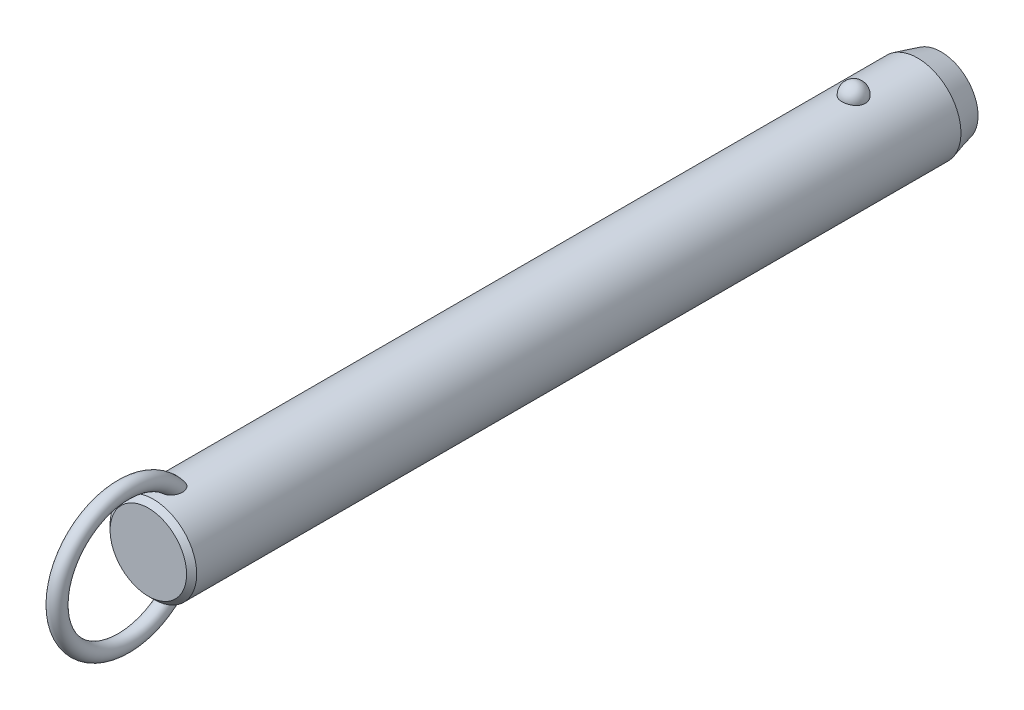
ISO-10303-21;
HEADER;
FILE_DESCRIPTION(('STEP AP214'),'2;1');
FILE_NAME('part.step','',(''),(''),'','','');
FILE_SCHEMA(('AUTOMOTIVE_DESIGN { 1 0 10303 214 1 1 1 1 }'));
ENDSEC;
DATA;
#1=APPLICATION_CONTEXT('core data for automotive mechanical design processes');
#2=APPLICATION_PROTOCOL_DEFINITION('international standard','automotive_design',2000,#1);
#3=PRODUCT_CONTEXT('',#1,'mechanical');
#4=PRODUCT('Part','Part','',(#3));
#5=PRODUCT_RELATED_PRODUCT_CATEGORY('part','',(#4));
#6=PRODUCT_DEFINITION_FORMATION('','',#4);
#7=PRODUCT_DEFINITION_CONTEXT('part definition',#1,'design');
#8=PRODUCT_DEFINITION('design','',#6,#7);
#9=PRODUCT_DEFINITION_SHAPE('','',#8);
#10=(LENGTH_UNIT() NAMED_UNIT(*) SI_UNIT(.MILLI.,.METRE.));
#11=(NAMED_UNIT(*) PLANE_ANGLE_UNIT() SI_UNIT($,.RADIAN.));
#12=(NAMED_UNIT(*) SI_UNIT($,.STERADIAN.) SOLID_ANGLE_UNIT());
#13=UNCERTAINTY_MEASURE_WITH_UNIT(LENGTH_MEASURE(1.E-05),#10,'distance_accuracy_value','');
#14=(GEOMETRIC_REPRESENTATION_CONTEXT(3) GLOBAL_UNCERTAINTY_ASSIGNED_CONTEXT((#13)) GLOBAL_UNIT_ASSIGNED_CONTEXT((#10,
#11,#12)) REPRESENTATION_CONTEXT('',''));
#15=CARTESIAN_POINT('',(0.,0.,0.));
#16=DIRECTION('',(0.,0.,1.));
#17=DIRECTION('',(1.,0.,0.));
#18=AXIS2_PLACEMENT_3D('',#15,#16,#17);
#19=CARTESIAN_POINT('',(0.,0.,165.1));
#20=DIRECTION('',(0.,0.,-1.));
#21=DIRECTION('',(-1.,0.,0.));
#22=AXIS2_PLACEMENT_3D('',#19,#20,#21);
#23=CYLINDRICAL_SURFACE('',#22,11.1);
#24=CARTESIAN_POINT('',(2.9724815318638,10.6945945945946,-3.00000000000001));
#25=CARTESIAN_POINT('',(2.97247830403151,10.6945972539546,-2.8322505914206));
#26=CARTESIAN_POINT('',(2.95876598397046,10.6984356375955,-2.66445972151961));
#27=CARTESIAN_POINT('',(2.90424529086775,10.7133624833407,-2.3336238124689));
#28=CARTESIAN_POINT('',(2.8634252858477,10.7244540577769,-2.17058084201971));
#29=CARTESIAN_POINT('',(2.75573657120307,10.7526272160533,-1.85396767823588));
#30=CARTESIAN_POINT('',(2.68887937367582,10.7697061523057,-1.70039333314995));
#31=CARTESIAN_POINT('',(2.53079696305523,10.8079438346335,-1.4069159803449));
#32=CARTESIAN_POINT('',(2.43957264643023,10.8291024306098,-1.26701246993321));
#33=CARTESIAN_POINT('',(2.23458150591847,10.8732541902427,-1.00409565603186));
#34=CARTESIAN_POINT('',(2.12071295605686,10.8962553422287,-0.881162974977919));
#35=CARTESIAN_POINT('',(1.87365402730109,10.9414421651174,-0.656352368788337));
#36=CARTESIAN_POINT('',(1.74046358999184,10.9636278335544,-0.554474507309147));
#37=CARTESIAN_POINT('',(1.45872188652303,11.0046495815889,-0.374872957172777));
#38=CARTESIAN_POINT('',(1.31021276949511,11.0234944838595,-0.297085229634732));
#39=CARTESIAN_POINT('',(1.00170030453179,11.0557957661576,-0.167529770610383));
#40=CARTESIAN_POINT('',(0.841698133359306,11.0692526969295,-0.1157593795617));
#41=CARTESIAN_POINT('',(0.517607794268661,11.0890932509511,-0.0403925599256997));
#42=CARTESIAN_POINT('',(0.353633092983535,11.0955916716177,-0.0163383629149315));
#43=CARTESIAN_POINT('',(0.0238420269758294,11.1011989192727,0.00445177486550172));
#44=CARTESIAN_POINT('',(-0.141974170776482,11.1003084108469,0.00119017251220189));
#45=CARTESIAN_POINT('',(-0.468405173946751,11.0912990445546,-0.0323233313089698));
#46=CARTESIAN_POINT('',(-0.629059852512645,11.0832767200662,-0.062214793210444));
#47=CARTESIAN_POINT('',(-0.942937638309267,11.0609962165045,-0.147645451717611));
#48=CARTESIAN_POINT('',(-1.09616062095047,11.0467379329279,-0.203185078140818));
#49=CARTESIAN_POINT('',(-1.39181061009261,11.0134071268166,-0.338752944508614));
#50=CARTESIAN_POINT('',(-1.53417383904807,10.9943086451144,-0.418913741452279));
#51=CARTESIAN_POINT('',(-1.80342160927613,10.9533667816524,-0.601448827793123));
#52=CARTESIAN_POINT('',(-1.9303046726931,10.9315231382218,-0.703825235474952));
#53=CARTESIAN_POINT('',(-2.16747598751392,10.887005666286,-0.930091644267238));
#54=CARTESIAN_POINT('',(-2.27742774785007,10.8643239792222,-1.05433291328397));
#55=CARTESIAN_POINT('',(-2.47517316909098,10.8209886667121,-1.31966633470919));
#56=CARTESIAN_POINT('',(-2.56296538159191,10.8003351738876,-1.46075958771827));
#57=CARTESIAN_POINT('',(-2.71500300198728,10.7631304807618,-1.75753646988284));
#58=CARTESIAN_POINT('',(-2.77898901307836,10.7466250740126,-1.91335887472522));
#59=CARTESIAN_POINT('',(-2.88046189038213,10.7198747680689,-2.23391529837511));
#60=CARTESIAN_POINT('',(-2.91794947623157,10.709629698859,-2.3986490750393));
#61=CARTESIAN_POINT('',(-2.96537819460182,10.6965949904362,-2.73165170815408));
#62=CARTESIAN_POINT('',(-2.97542891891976,10.693775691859,-2.89990378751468));
#63=CARTESIAN_POINT('',(-2.96804271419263,10.6958279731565,-3.23575286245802));
#64=CARTESIAN_POINT('',(-2.95060646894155,10.7006993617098,-3.4033498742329));
#65=CARTESIAN_POINT('',(-2.88883358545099,10.71753912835,-3.73233906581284));
#66=CARTESIAN_POINT('',(-2.84462026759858,10.7294749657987,-3.89375610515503));
#67=CARTESIAN_POINT('',(-2.73050447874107,10.7590797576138,-4.20667949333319));
#68=CARTESIAN_POINT('',(-2.66060103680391,10.7767489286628,-4.35818546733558));
#69=CARTESIAN_POINT('',(-2.49642559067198,10.8159599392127,-4.64785421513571));
#70=CARTESIAN_POINT('',(-2.40203047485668,10.8375211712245,-4.78594458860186));
#71=CARTESIAN_POINT('',(-2.19143488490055,10.8820570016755,-5.04410382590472));
#72=CARTESIAN_POINT('',(-2.07523364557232,10.9050316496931,-5.16417205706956));
#73=CARTESIAN_POINT('',(-1.82361254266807,10.9499219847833,-5.3833483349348));
#74=CARTESIAN_POINT('',(-1.68812945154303,10.9718338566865,-5.48238464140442));
#75=CARTESIAN_POINT('',(-1.40191298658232,11.0120611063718,-5.65618873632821));
#76=CARTESIAN_POINT('',(-1.25118062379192,11.0303767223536,-5.73095813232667));
#77=CARTESIAN_POINT('',(-0.940570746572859,11.0611653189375,-5.85334725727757));
#78=CARTESIAN_POINT('',(-0.780821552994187,11.0737044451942,-5.90127578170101));
#79=CARTESIAN_POINT('',(-0.455204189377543,11.0918598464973,-5.96992976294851));
#80=CARTESIAN_POINT('',(-0.289336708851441,11.0974768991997,-5.99065827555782));
#81=CARTESIAN_POINT('',(0.0406846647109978,11.1011307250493,-6.00418773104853));
#82=CARTESIAN_POINT('',(0.204817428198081,11.099299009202,-5.9974731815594));
#83=CARTESIAN_POINT('',(0.5295530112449,11.088551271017,-5.95740317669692));
#84=CARTESIAN_POINT('',(0.69015594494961,11.0796354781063,-5.92404858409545));
#85=CARTESIAN_POINT('',(1.0027760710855,11.0557204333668,-5.83180084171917));
#86=CARTESIAN_POINT('',(1.15482001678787,11.0407414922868,-5.7729929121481));
#87=CARTESIAN_POINT('',(1.44678373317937,11.0062913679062,-5.63147366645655));
#88=CARTESIAN_POINT('',(1.58670279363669,10.9868199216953,-5.54876095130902));
#89=CARTESIAN_POINT('',(1.8527023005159,10.9451315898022,-5.36027644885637));
#90=CARTESIAN_POINT('',(1.97855158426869,10.9228788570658,-5.25418644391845));
#91=CARTESIAN_POINT('',(2.21080872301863,10.8782509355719,-5.02251354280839));
#92=CARTESIAN_POINT('',(2.31721312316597,10.8558757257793,-4.89692718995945));
#93=CARTESIAN_POINT('',(2.5094551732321,10.8130715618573,-4.62745408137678));
#94=CARTESIAN_POINT('',(2.59493284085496,10.7926798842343,-4.48330448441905));
#95=CARTESIAN_POINT('',(2.740862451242,10.7565495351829,-4.18236358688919));
#96=CARTESIAN_POINT('',(2.80132490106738,10.7408089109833,-4.02557762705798));
#97=CARTESIAN_POINT('',(2.88959070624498,10.7173718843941,-3.72475308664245));
#98=CARTESIAN_POINT('',(2.92062102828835,10.7088950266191,-3.58171216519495));
#99=CARTESIAN_POINT('',(2.96206765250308,10.6975052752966,-3.29245795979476));
#100=CARTESIAN_POINT('',(2.97248434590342,10.6945922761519,-3.14624473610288));
#101=CARTESIAN_POINT('',(2.9724815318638,10.6945945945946,-3.00000000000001));
#102=B_SPLINE_CURVE_WITH_KNOTS('',3,(#24,#25,#26,#27,#28,#29,#30,#31,#32,#33,#34,#35,#36,#37,
#38,#39,#40,#41,#42,#43,#44,#45,#46,#47,#48,#49,#50,#51,#52,#53,#54,#55,#56,#57,#58,#59,#60,#61,
#62,#63,#64,#65,#66,#67,#68,#69,#70,#71,#72,#73,#74,#75,#76,#77,#78,#79,#80,#81,#82,#83,#84,#85,
#86,#87,#88,#89,#90,#91,#92,#93,#94,#95,#96,#97,#98,#99,#100,#101),.UNSPECIFIED.,.T.,.F.,(4,2,2,
2,2,2,2,2,2,2,2,2,2,2,2,2,2,2,2,2,2,2,2,2,2,2,2,2,2,2,2,2,2,2,2,2,2,2,4),(0.,0.502722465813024,
1.00566079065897,1.5083769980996,2.01107471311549,2.51608392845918,3.02109467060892,
3.52475118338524,4.02835620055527,4.523518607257,5.0186364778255,5.50715297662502,
5.9956776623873,6.48688002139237,6.97812923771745,7.47814366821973,7.9781907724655,
8.48353712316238,8.9888697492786,9.49218093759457,9.99547960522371,10.4964777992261,
10.997494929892,11.5010810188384,12.0046847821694,12.5099796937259,13.0152411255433,
13.5145635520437,14.0138298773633,14.5043200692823,14.9947943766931,15.4836390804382,
15.9725123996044,16.4685040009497,16.9645836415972,17.4686765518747,17.972557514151,
18.410841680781,18.849117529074),.UNSPECIFIED.);
#103=CARTESIAN_POINT('',(2.9724815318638,10.6945945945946,-3.00000000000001));
#104=VERTEX_POINT('',#103);
#105=EDGE_CURVE('E41',#104,#104,#102,.T.);
#106=ORIENTED_EDGE('',*,*,#105,.T.);
#107=EDGE_LOOP('',(#106));
#108=FACE_BOUND('',#107,.T.);
#109=CARTESIAN_POINT('',(0.,0.,176.5));
#110=DIRECTION('',(0.,0.,1.));
#111=DIRECTION('',(1.,0.,0.));
#112=AXIS2_PLACEMENT_3D('',#109,#110,#111);
#113=CIRCLE('',#112,11.1);
#114=CARTESIAN_POINT('',(11.1,0.,176.5));
#115=VERTEX_POINT('',#114);
#116=EDGE_CURVE('E10',#115,#115,#113,.F.);
#117=ORIENTED_EDGE('',*,*,#116,.T.);
#118=EDGE_LOOP('',(#117));
#119=FACE_BOUND('',#118,.T.);
#120=CARTESIAN_POINT('',(-0.564520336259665,-11.0856356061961,168.757815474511));
#121=CARTESIAN_POINT('',(-0.667202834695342,-11.0804062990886,168.791283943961));
#122=CARTESIAN_POINT('',(-0.766875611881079,-11.0738877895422,168.833835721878));
#123=CARTESIAN_POINT('',(-0.957284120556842,-11.0590576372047,168.935419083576));
#124=CARTESIAN_POINT('',(-1.04801616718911,-11.0507452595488,168.99445742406));
#125=CARTESIAN_POINT('',(-1.21800952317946,-11.0333016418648,169.126529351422));
#126=CARTESIAN_POINT('',(-1.29730805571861,-11.0241732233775,169.199515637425));
#127=CARTESIAN_POINT('',(-1.44337665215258,-11.0060026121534,169.357037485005));
#128=CARTESIAN_POINT('',(-1.51014622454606,-10.9969604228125,169.441573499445));
#129=CARTESIAN_POINT('',(-1.63454620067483,-10.9791841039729,169.625521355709));
#130=CARTESIAN_POINT('',(-1.69127003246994,-10.9705107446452,169.725549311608));
#131=CARTESIAN_POINT('',(-1.7898078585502,-10.9548648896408,169.932790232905));
#132=CARTESIAN_POINT('',(-1.83161214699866,-10.9478935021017,170.040007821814));
#133=CARTESIAN_POINT('',(-1.91557028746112,-10.9335803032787,170.305408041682));
#134=CARTESIAN_POINT('',(-1.95040620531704,-10.9273269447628,170.465980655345));
#135=CARTESIAN_POINT('',(-1.99388326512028,-10.9194709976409,170.790697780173));
#136=CARTESIAN_POINT('',(-2.00248051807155,-10.9178762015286,170.954847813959));
#137=CARTESIAN_POINT('',(-1.99551615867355,-10.9191578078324,171.324650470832));
#138=CARTESIAN_POINT('',(-1.97322066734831,-10.9232807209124,171.530191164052));
#139=CARTESIAN_POINT('',(-1.91529761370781,-10.9335244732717,171.833595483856));
#140=CARTESIAN_POINT('',(-1.89184575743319,-10.9376266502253,171.934088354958));
#141=CARTESIAN_POINT('',(-1.83700674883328,-10.9469720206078,172.132855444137));
#142=CARTESIAN_POINT('',(-1.80562070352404,-10.9522150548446,172.231129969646));
#143=CARTESIAN_POINT('',(-1.73463055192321,-10.9636837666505,172.425914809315));
#144=CARTESIAN_POINT('',(-1.6949341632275,-10.9699202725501,172.522390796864));
#145=CARTESIAN_POINT('',(-1.60745141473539,-10.9830806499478,172.711626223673));
#146=CARTESIAN_POINT('',(-1.55966150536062,-10.9900048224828,172.804384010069));
#147=CARTESIAN_POINT('',(-1.45591812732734,-11.0042280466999,172.984690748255));
#148=CARTESIAN_POINT('',(-1.40000013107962,-11.0115253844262,173.072260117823));
#149=CARTESIAN_POINT('',(-1.27937470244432,-11.0261911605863,173.241029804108));
#150=CARTESIAN_POINT('',(-1.21467835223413,-11.0335594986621,173.32223795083));
#151=CARTESIAN_POINT('',(-1.08218150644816,-11.0473027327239,173.469001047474));
#152=CARTESIAN_POINT('',(-1.01522633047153,-11.0537063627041,173.535309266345));
#153=CARTESIAN_POINT('',(-0.872952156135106,-11.065850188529,173.658378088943));
#154=CARTESIAN_POINT('',(-0.797642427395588,-11.0715911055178,173.715149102));
#155=CARTESIAN_POINT('',(-0.651396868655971,-11.081071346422,173.807515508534));
#156=CARTESIAN_POINT('',(-0.581712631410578,-11.0849841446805,173.845049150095));
#157=CARTESIAN_POINT('',(-0.437066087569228,-11.0916271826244,173.908259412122));
#158=CARTESIAN_POINT('',(-0.362109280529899,-11.0943586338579,173.933948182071));
#159=CARTESIAN_POINT('',(-0.207828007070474,-11.0983242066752,173.971117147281));
#160=CARTESIAN_POINT('',(-0.12846771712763,-11.0995432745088,173.982454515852));
#161=CARTESIAN_POINT('',(0.0309101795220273,-11.1002423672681,173.988965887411));
#162=CARTESIAN_POINT('',(0.110927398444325,-11.0997233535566,173.984148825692));
#163=CARTESIAN_POINT('',(0.25640659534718,-11.097240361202,173.960959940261));
#164=CARTESIAN_POINT('',(0.322235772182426,-11.0955074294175,173.944754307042));
#165=CARTESIAN_POINT('',(0.450635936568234,-11.0910350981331,173.902600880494));
#166=CARTESIAN_POINT('',(0.513205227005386,-11.0882951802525,173.876648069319));
#167=CARTESIAN_POINT('',(0.662626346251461,-11.0805620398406,173.802607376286));
#168=CARTESIAN_POINT('',(0.747127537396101,-11.0751144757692,173.749845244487));
#169=CARTESIAN_POINT('',(0.906756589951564,-11.0631932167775,173.631720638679));
#170=CARTESIAN_POINT('',(0.981859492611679,-11.0567168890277,173.566325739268));
#171=CARTESIAN_POINT('',(1.10712207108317,-11.0447856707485,173.44226337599));
#172=CARTESIAN_POINT('',(1.15909566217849,-11.0394280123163,173.385383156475));
#173=CARTESIAN_POINT('',(1.25791923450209,-11.0286040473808,173.267327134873));
#174=CARTESIAN_POINT('',(1.30476642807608,-11.0231376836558,173.206149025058));
#175=CARTESIAN_POINT('',(1.43818612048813,-11.0068027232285,173.017305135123));
#176=CARTESIAN_POINT('',(1.51751767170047,-10.9960104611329,172.884453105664));
#177=CARTESIAN_POINT('',(1.63597546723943,-10.9788847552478,172.653137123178));
#178=CARTESIAN_POINT('',(1.67988876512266,-10.9722190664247,172.557053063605));
#179=CARTESIAN_POINT('',(1.75953241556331,-10.9597298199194,172.361431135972));
#180=CARTESIAN_POINT('',(1.79525967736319,-10.9539065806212,172.261891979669));
#181=CARTESIAN_POINT('',(1.85844731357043,-10.9433632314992,172.06021118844));
#182=CARTESIAN_POINT('',(1.88591073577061,-10.9386427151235,171.95807052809));
#183=CARTESIAN_POINT('',(1.93234324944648,-10.9305350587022,171.751819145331));
#184=CARTESIAN_POINT('',(1.95131065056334,-10.9271481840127,171.647708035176));
#185=CARTESIAN_POINT('',(1.9904020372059,-10.9201183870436,171.365458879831));
#186=CARTESIAN_POINT('',(2.00221217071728,-10.9179256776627,171.186037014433));
#187=CARTESIAN_POINT('',(1.99711676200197,-10.9188636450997,170.827713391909));
#188=CARTESIAN_POINT('',(1.98026150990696,-10.9219849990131,170.648811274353));
#189=CARTESIAN_POINT('',(1.92151657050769,-10.9324473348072,170.33645144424));
#190=CARTESIAN_POINT('',(1.88605081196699,-10.9386915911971,170.201759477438));
#191=CARTESIAN_POINT('',(1.79393020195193,-10.9541780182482,169.939966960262));
#192=CARTESIAN_POINT('',(1.73729868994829,-10.9634168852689,169.812858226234));
#193=CARTESIAN_POINT('',(1.61237037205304,-10.9824218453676,169.589418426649));
#194=CARTESIAN_POINT('',(1.54715374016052,-10.9918945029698,169.491345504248));
#195=CARTESIAN_POINT('',(1.40127026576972,-11.0114415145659,169.307434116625));
#196=CARTESIAN_POINT('',(1.32060742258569,-11.0215157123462,169.221592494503));
#197=CARTESIAN_POINT('',(1.1447478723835,-11.041168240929,169.065163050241));
#198=CARTESIAN_POINT('',(1.04947805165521,-11.0507437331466,168.994656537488));
#199=CARTESIAN_POINT('',(0.847278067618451,-11.0680789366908,168.872640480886));
#200=CARTESIAN_POINT('',(0.740351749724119,-11.0758392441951,168.821124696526));
#201=CARTESIAN_POINT('',(0.529289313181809,-11.0878275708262,168.743485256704));
#202=CARTESIAN_POINT('',(0.425895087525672,-11.0923259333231,168.715377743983));
#203=CARTESIAN_POINT('',(0.215723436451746,-11.0984001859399,168.677703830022));
#204=CARTESIAN_POINT('',(0.10894793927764,-11.0999777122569,168.668127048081));
#205=CARTESIAN_POINT('',(-0.0938962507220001,-11.1000196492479,168.667877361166));
#206=CARTESIAN_POINT('',(-0.189967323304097,-11.0987797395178,168.675408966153));
#207=CARTESIAN_POINT('',(-0.379657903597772,-11.0939111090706,168.705507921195));
#208=CARTESIAN_POINT('',(-0.473277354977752,-11.0902823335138,168.728075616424));
#209=CARTESIAN_POINT('',(-0.564520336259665,-11.0856356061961,168.757815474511));
#210=B_SPLINE_CURVE_WITH_KNOTS('',3,(#120,#121,#122,#123,#124,#125,#126,#127,#128,#129,#130,
#131,#132,#133,#134,#135,#136,#137,#138,#139,#140,#141,#142,#143,#144,#145,#146,#147,#148,#149,
#150,#151,#152,#153,#154,#155,#156,#157,#158,#159,#160,#161,#162,#163,#164,#165,#166,#167,#168,
#169,#170,#171,#172,#173,#174,#175,#176,#177,#178,#179,#180,#181,#182,#183,#184,#185,#186,#187,
#188,#189,#190,#191,#192,#193,#194,#195,#196,#197,#198,#199,#200,#201,#202,#203,#204,#205,#206,
#207,#208,#209),.UNSPECIFIED.,.T.,.F.,(4,2,2,2,2,2,2,2,2,2,2,2,2,2,2,2,2,2,2,2,2,2,2,2,2,2,2,2,
2,2,2,2,2,2,2,2,2,2,2,2,2,2,2,2,4),(0.,0.323999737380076,0.648132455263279,0.971184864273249,
1.29424994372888,1.63886237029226,1.98369857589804,2.47426059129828,2.96564271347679,
3.58257396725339,3.89215258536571,4.20168803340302,4.51486273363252,4.82817514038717,
5.14015911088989,5.45175282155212,5.73442856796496,6.01679375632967,6.25364580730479,
6.49025437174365,6.72919963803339,6.96801276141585,7.17061258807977,7.37331685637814,
7.67094989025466,7.96935728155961,8.20075067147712,8.43226927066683,8.89581623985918,
9.21306533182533,9.5304340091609,9.84768549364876,10.1650000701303,10.7022930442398,
11.2386443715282,11.655339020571,12.071575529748,12.4245637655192,12.7774607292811,
13.1321855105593,13.4867936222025,13.8068771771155,14.1267813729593,14.4146787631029,
14.7025827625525),.UNSPECIFIED.);
#211=CARTESIAN_POINT('',(-0.564520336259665,-11.0856356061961,168.757815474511));
#212=VERTEX_POINT('',#211);
#213=EDGE_CURVE('E59',#212,#212,#210,.T.);
#214=ORIENTED_EDGE('',*,*,#213,.T.);
#215=EDGE_LOOP('',(#214));
#216=FACE_BOUND('',#215,.T.);
#217=CARTESIAN_POINT('',(-0.564520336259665,11.0856356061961,168.757815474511));
#218=CARTESIAN_POINT('',(-0.468542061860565,11.0905203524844,168.726545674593));
#219=CARTESIAN_POINT('',(-0.369793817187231,11.0942886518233,168.703157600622));
#220=CARTESIAN_POINT('',(-0.169555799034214,11.0991586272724,168.673085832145));
#221=CARTESIAN_POINT('',(-0.0680604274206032,11.1002543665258,168.66643932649));
#222=CARTESIAN_POINT('',(0.13454973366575,11.099646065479,168.670157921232));
#223=CARTESIAN_POINT('',(0.235664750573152,11.0979441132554,168.68051033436));
#224=CARTESIAN_POINT('',(0.434632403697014,11.0919342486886,168.717831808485));
#225=CARTESIAN_POINT('',(0.532486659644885,11.0876276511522,168.744792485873));
#226=CARTESIAN_POINT('',(0.722445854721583,11.0768742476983,168.8144096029));
#227=CARTESIAN_POINT('',(0.814543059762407,11.0704246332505,168.857086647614));
#228=CARTESIAN_POINT('',(0.990565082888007,11.0560659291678,168.956648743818));
#229=CARTESIAN_POINT('',(1.07448844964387,11.048156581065,169.013536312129));
#230=CARTESIAN_POINT('',(1.23562672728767,11.0313221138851,169.142210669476));
#231=CARTESIAN_POINT('',(1.3124268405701,11.0223686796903,169.214511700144));
#232=CARTESIAN_POINT('',(1.45398030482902,11.0045918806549,169.370042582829));
#233=CARTESIAN_POINT('',(1.51873073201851,10.9957685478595,169.453275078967));
#234=CARTESIAN_POINT('',(1.64107232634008,10.9782087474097,169.636384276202));
#235=CARTESIAN_POINT('',(1.6974317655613,10.9695572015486,169.737089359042));
#236=CARTESIAN_POINT('',(1.79515063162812,10.9539887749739,169.945626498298));
#237=CARTESIAN_POINT('',(1.83649966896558,10.9470730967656,170.05346343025));
#238=CARTESIAN_POINT('',(1.91931148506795,10.9329211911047,170.320399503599));
#239=CARTESIAN_POINT('',(1.95340104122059,10.9267904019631,170.481861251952));
#240=CARTESIAN_POINT('',(1.99526195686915,10.9192174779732,170.80821631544));
#241=CARTESIAN_POINT('',(2.00298989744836,10.9177830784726,170.97311484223));
#242=CARTESIAN_POINT('',(1.99396251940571,10.9194420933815,171.344100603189));
#243=CARTESIAN_POINT('',(1.97050829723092,10.923774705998,171.55003871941));
#244=CARTESIAN_POINT('',(1.91079643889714,10.9343131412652,171.853901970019));
#245=CARTESIAN_POINT('',(1.88673702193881,10.9385106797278,171.954529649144));
#246=CARTESIAN_POINT('',(1.83065508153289,10.9480376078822,172.153510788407));
#247=CARTESIAN_POINT('',(1.79863369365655,10.9533668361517,172.251864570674));
#248=CARTESIAN_POINT('',(1.72633365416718,10.9649954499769,172.446720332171));
#249=CARTESIAN_POINT('',(1.68596409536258,10.9713053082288,172.54318790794));
#250=CARTESIAN_POINT('',(1.59707998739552,10.9845964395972,172.732323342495));
#251=CARTESIAN_POINT('',(1.54856169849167,10.9915780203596,172.824989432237));
#252=CARTESIAN_POINT('',(1.44330168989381,11.0058935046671,173.004975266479));
#253=CARTESIAN_POINT('',(1.38659749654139,11.0132257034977,173.092316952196));
#254=CARTESIAN_POINT('',(1.26431158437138,11.0279330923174,173.260456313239));
#255=CARTESIAN_POINT('',(1.198741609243,11.0353082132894,173.341262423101));
#256=CARTESIAN_POINT('',(1.06542088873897,11.048931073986,173.485985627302));
#257=CARTESIAN_POINT('',(0.998640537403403,11.0552153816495,173.550784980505));
#258=CARTESIAN_POINT('',(0.856896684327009,11.0671032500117,173.670846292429));
#259=CARTESIAN_POINT('',(0.781942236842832,11.0727075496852,173.726118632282));
#260=CARTESIAN_POINT('',(0.636276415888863,11.081949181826,173.815972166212));
#261=CARTESIAN_POINT('',(0.566755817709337,11.0857572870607,173.852441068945));
#262=CARTESIAN_POINT('',(0.42260242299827,11.0921860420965,173.913533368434));
#263=CARTESIAN_POINT('',(0.347974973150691,11.0948079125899,173.938168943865));
#264=CARTESIAN_POINT('',(0.194593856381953,11.0985608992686,173.973323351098));
#265=CARTESIAN_POINT('',(0.115807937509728,11.0996777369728,173.983706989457));
#266=CARTESIAN_POINT('',(-0.0422499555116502,11.1002003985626,173.988574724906));
#267=CARTESIAN_POINT('',(-0.121521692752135,11.09960699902,173.983066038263));
#268=CARTESIAN_POINT('',(-0.266046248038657,11.0970123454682,173.958827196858));
#269=CARTESIAN_POINT('',(-0.331661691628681,11.0952283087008,173.942135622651));
#270=CARTESIAN_POINT('',(-0.45958809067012,11.0906663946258,173.899111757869));
#271=CARTESIAN_POINT('',(-0.52189737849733,11.0878880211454,173.872774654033));
#272=CARTESIAN_POINT('',(-0.671446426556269,11.0800342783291,173.797513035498));
#273=CARTESIAN_POINT('',(-0.756250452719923,11.0744969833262,173.743818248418));
#274=CARTESIAN_POINT('',(-0.916349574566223,11.0624045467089,173.623802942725));
#275=CARTESIAN_POINT('',(-0.991618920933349,11.0558467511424,173.557449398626));
#276=CARTESIAN_POINT('',(-1.11713140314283,11.0437783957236,173.431633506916));
#277=CARTESIAN_POINT('',(-1.16920539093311,11.0383619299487,173.373952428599));
#278=CARTESIAN_POINT('',(-1.26817476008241,11.02743010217,173.254280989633));
#279=CARTESIAN_POINT('',(-1.31506731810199,11.0219146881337,173.192288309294));
#280=CARTESIAN_POINT('',(-1.40399813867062,11.0109399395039,173.064784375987));
#281=CARTESIAN_POINT('',(-1.44602864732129,11.0054807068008,172.999267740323));
#282=CARTESIAN_POINT('',(-1.52538779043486,10.9947621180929,172.865422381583));
#283=CARTESIAN_POINT('',(-1.56271516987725,10.9895028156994,172.797092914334));
#284=CARTESIAN_POINT('',(-1.64537943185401,10.9774790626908,172.633210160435));
#285=CARTESIAN_POINT('',(-1.68879497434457,10.9708503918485,172.5366735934));
#286=CARTESIAN_POINT('',(-1.76740738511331,10.9584602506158,172.340236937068));
#287=CARTESIAN_POINT('',(-1.80260120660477,10.95269910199,172.24033561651));
#288=CARTESIAN_POINT('',(-1.86468657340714,10.9423003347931,172.037966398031));
#289=CARTESIAN_POINT('',(-1.8915816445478,10.9376622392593,171.935499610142));
#290=CARTESIAN_POINT('',(-1.93682458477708,10.9297405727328,171.728642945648));
#291=CARTESIAN_POINT('',(-1.95517082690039,10.9264572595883,171.624252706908));
#292=CARTESIAN_POINT('',(-1.99232562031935,10.9197647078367,171.34262876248));
#293=CARTESIAN_POINT('',(-2.00294603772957,10.9177914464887,171.164185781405));
#294=CARTESIAN_POINT('',(-1.99566675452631,10.9191290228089,170.807996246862));
#295=CARTESIAN_POINT('',(-1.97781651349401,10.9224306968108,170.63024902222));
#296=CARTESIAN_POINT('',(-1.91747214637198,10.93315926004,170.319792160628));
#297=CARTESIAN_POINT('',(-1.88131022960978,10.9395108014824,170.185825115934));
#298=CARTESIAN_POINT('',(-1.78790380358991,10.9551659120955,169.92559757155));
#299=CARTESIAN_POINT('',(-1.7306830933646,10.9644661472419,169.799328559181));
#300=CARTESIAN_POINT('',(-1.60475573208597,10.9835398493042,169.57741565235));
#301=CARTESIAN_POINT('',(-1.53908879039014,10.9930297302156,169.480026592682));
#302=CARTESIAN_POINT('',(-1.39238608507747,11.0125708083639,169.297525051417));
#303=CARTESIAN_POINT('',(-1.31135150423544,11.0226219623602,169.212411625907));
#304=CARTESIAN_POINT('',(-1.14382035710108,11.0411991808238,169.06529943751));
#305=CARTESIAN_POINT('',(-1.0585850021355,11.0497792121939,169.00186930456));
#306=CARTESIAN_POINT('',(-0.878723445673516,11.0655285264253,168.890250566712));
#307=CARTESIAN_POINT('',(-0.784123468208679,11.0727015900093,168.842020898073));
#308=CARTESIAN_POINT('',(-0.646163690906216,11.0812501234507,168.786023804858));
#309=CARTESIAN_POINT('',(-0.605595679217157,11.0835451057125,168.771197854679));
#310=CARTESIAN_POINT('',(-0.564520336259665,11.0856356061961,168.757815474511));
#311=B_SPLINE_CURVE_WITH_KNOTS('',3,(#217,#218,#219,#220,#221,#222,#223,#224,#225,#226,#227,
#228,#229,#230,#231,#232,#233,#234,#235,#236,#237,#238,#239,#240,#241,#242,#243,#244,#245,#246,
#247,#248,#249,#250,#251,#252,#253,#254,#255,#256,#257,#258,#259,#260,#261,#262,#263,#264,#265,
#266,#267,#268,#269,#270,#271,#272,#273,#274,#275,#276,#277,#278,#279,#280,#281,#282,#283,#284,
#285,#286,#287,#288,#289,#290,#291,#292,#293,#294,#295,#296,#297,#298,#299,#300,#301,#302,#303,
#304,#305,#306,#307,#308,#309,#310),.UNSPECIFIED.,.T.,.F.,(4,2,2,2,2,2,2,2,2,2,2,2,2,2,2,2,2,2,
2,2,2,2,2,2,2,2,2,2,2,2,2,2,2,2,2,2,2,2,2,2,2,2,2,2,2,2,4),(0.,0.303061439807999,
0.606795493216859,0.910302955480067,1.21365733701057,1.51741085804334,1.82121821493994,
2.13745205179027,2.45376252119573,2.799586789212,3.14564996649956,3.63832391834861,
4.13180893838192,4.75031912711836,5.06071926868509,5.37107516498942,5.68500772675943,
5.99908475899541,6.31176519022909,6.62403542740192,6.90315673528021,7.18197194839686,
7.41687778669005,7.65154134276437,7.88841587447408,8.12518286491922,8.32752842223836,
8.52997509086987,8.82986421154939,9.13054668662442,9.36393502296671,9.59744991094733,
9.83133221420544,10.0652767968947,10.3830324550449,10.7009056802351,11.0186436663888,
11.3364420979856,11.8705925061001,12.4038159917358,12.8189662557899,13.2336487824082,
13.5857049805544,13.9377340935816,14.2561354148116,14.5736690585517,14.7033687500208),.UNSPECIFIED.);
#312=CARTESIAN_POINT('',(-0.564520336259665,11.0856356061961,168.757815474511));
#313=VERTEX_POINT('',#312);
#314=EDGE_CURVE('E67',#313,#313,#311,.T.);
#315=ORIENTED_EDGE('',*,*,#314,.T.);
#316=EDGE_LOOP('',(#315));
#317=FACE_BOUND('',#316,.T.);
#318=CARTESIAN_POINT('',(0.,0.,-19.3999999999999));
#319=DIRECTION('',(0.,0.,-1.));
#320=DIRECTION('',(-1.,0.,0.));
#321=AXIS2_PLACEMENT_3D('',#318,#319,#320);
#322=CIRCLE('',#321,11.1);
#323=CARTESIAN_POINT('',(-11.1,0.,-19.3999999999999));
#324=VERTEX_POINT('',#323);
#325=EDGE_CURVE('E56',#324,#324,#322,.F.);
#326=ORIENTED_EDGE('',*,*,#325,.T.);
#327=EDGE_LOOP('',(#326));
#328=FACE_BOUND('',#327,.T.);
#329=ADVANCED_FACE('F37',(#108,#119,#216,#317,#328),#23,.T.);
#330=CARTESIAN_POINT('',(0.,0.,-25.4));
#331=DIRECTION('',(0.,0.,-1.));
#332=DIRECTION('',(-1.,0.,0.));
#333=AXIS2_PLACEMENT_3D('',#330,#331,#332);
#334=PLANE('',#333);
#335=CARTESIAN_POINT('',(0.,0.,-25.4));
#336=DIRECTION('',(0.,0.,-1.));
#337=DIRECTION('',(-1.,0.,0.));
#338=AXIS2_PLACEMENT_3D('',#335,#336,#337);
#339=CIRCLE('',#338,9.49230484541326);
#340=CARTESIAN_POINT('',(-9.49230484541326,0.,-25.4));
#341=VERTEX_POINT('',#340);
#342=EDGE_CURVE('E66',#341,#341,#339,.T.);
#343=ORIENTED_EDGE('',*,*,#342,.T.);
#344=EDGE_LOOP('',(#343));
#345=FACE_BOUND('',#344,.T.);
#346=ADVANCED_FACE('F85',(#345),#334,.T.);
#347=CARTESIAN_POINT('',(0.,0.,-25.4));
#348=DIRECTION('',(0.,0.,1.));
#349=DIRECTION('',(1.,0.,0.));
#350=AXIS2_PLACEMENT_3D('',#347,#348,#349);
#351=CONICAL_SURFACE('',#350,9.49230484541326,0.261799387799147);
#352=ORIENTED_EDGE('',*,*,#325,.F.);
#353=EDGE_LOOP('',(#352));
#354=FACE_BOUND('',#353,.T.);
#355=ORIENTED_EDGE('',*,*,#342,.F.);
#356=EDGE_LOOP('',(#355));
#357=FACE_BOUND('',#356,.T.);
#358=ADVANCED_FACE('F83',(#354,#357),#351,.T.);
#359=CARTESIAN_POINT('',(0.,0.,177.8));
#360=DIRECTION('',(0.,0.,1.));
#361=DIRECTION('',(1.,0.,0.));
#362=AXIS2_PLACEMENT_3D('',#359,#360,#361);
#363=PLANE('',#362);
#364=CARTESIAN_POINT('',(0.,0.,177.8));
#365=DIRECTION('',(0.,0.,1.));
#366=DIRECTION('',(1.,0.,0.));
#367=AXIS2_PLACEMENT_3D('',#364,#365,#366);
#368=CIRCLE('',#367,9.80000000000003);
#369=CARTESIAN_POINT('',(9.80000000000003,0.,177.8));
#370=VERTEX_POINT('',#369);
#371=EDGE_CURVE('E50',#370,#370,#368,.T.);
#372=ORIENTED_EDGE('',*,*,#371,.T.);
#373=EDGE_LOOP('',(#372));
#374=FACE_BOUND('',#373,.T.);
#375=ADVANCED_FACE('F77',(#374),#363,.T.);
#376=CARTESIAN_POINT('',(0.,0.,184.15));
#377=DIRECTION('',(1.,0.,0.));
#378=DIRECTION('',(0.,0.,-1.));
#379=AXIS2_PLACEMENT_3D('',#376,#377,#378);
#380=TOROIDAL_SURFACE('',#379,17.05,2.);
#381=ORIENTED_EDGE('',*,*,#314,.F.);
#382=EDGE_LOOP('',(#381));
#383=FACE_BOUND('',#382,.T.);
#384=ORIENTED_EDGE('',*,*,#213,.F.);
#385=EDGE_LOOP('',(#384));
#386=FACE_BOUND('',#385,.T.);
#387=ADVANCED_FACE('F73',(#383,#386),#380,.T.);
#388=CARTESIAN_POINT('',(0.,0.,177.8));
#389=DIRECTION('',(0.,0.,-1.));
#390=DIRECTION('',(-1.,0.,0.));
#391=AXIS2_PLACEMENT_3D('',#388,#389,#390);
#392=CONICAL_SURFACE('',#391,9.80000000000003,0.785398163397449);
#393=ORIENTED_EDGE('',*,*,#116,.F.);
#394=EDGE_LOOP('',(#393));
#395=FACE_BOUND('',#394,.T.);
#396=ORIENTED_EDGE('',*,*,#371,.F.);
#397=EDGE_LOOP('',(#396));
#398=FACE_BOUND('',#397,.T.);
#399=ADVANCED_FACE('F39',(#395,#398),#392,.T.);
#400=CARTESIAN_POINT('',(0.,11.1,-3.00000000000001));
#401=DIRECTION('',(0.,1.,0.));
#402=DIRECTION('',(0.,0.,-1.));
#403=AXIS2_PLACEMENT_3D('',#400,#401,#402);
#404=SPHERICAL_SURFACE('',#403,3.);
#405=ORIENTED_EDGE('',*,*,#105,.F.);
#406=EDGE_LOOP('',(#405));
#407=FACE_BOUND('',#406,.T.);
#408=ADVANCED_FACE('F79',(#407),#404,.T.);
#409=CLOSED_SHELL('',(#329,#346,#358,#375,#387,#399,#408));
#410=MANIFOLD_SOLID_BREP('B2',#409);
#411=ADVANCED_BREP_SHAPE_REPRESENTATION('',(#18,#410),#14);
#412=SHAPE_DEFINITION_REPRESENTATION(#9,#411);
ENDSEC;
END-ISO-10303-21;
